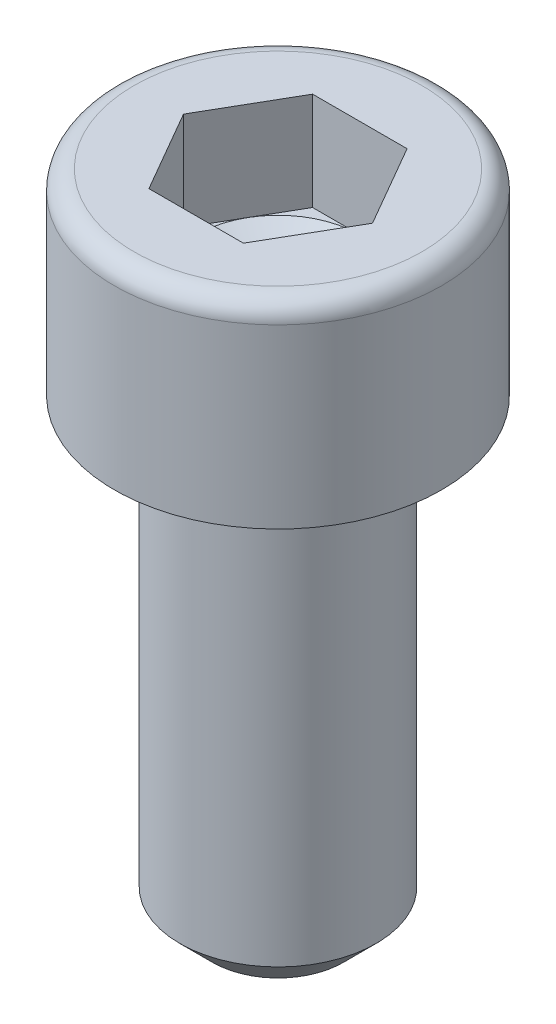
ISO-10303-21;
HEADER;
FILE_DESCRIPTION(('STEP AP214'),'2;1');
FILE_NAME('part.step','',(''),(''),'','','');
FILE_SCHEMA(('AUTOMOTIVE_DESIGN { 1 0 10303 214 1 1 1 1 }'));
ENDSEC;
DATA;
#1=APPLICATION_CONTEXT('core data for automotive mechanical design processes');
#2=APPLICATION_PROTOCOL_DEFINITION('international standard','automotive_design',2000,#1);
#3=PRODUCT_CONTEXT('',#1,'mechanical');
#4=PRODUCT('Part','Part','',(#3));
#5=PRODUCT_RELATED_PRODUCT_CATEGORY('part','',(#4));
#6=PRODUCT_DEFINITION_FORMATION('','',#4);
#7=PRODUCT_DEFINITION_CONTEXT('part definition',#1,'design');
#8=PRODUCT_DEFINITION('design','',#6,#7);
#9=PRODUCT_DEFINITION_SHAPE('','',#8);
#10=(LENGTH_UNIT() NAMED_UNIT(*) SI_UNIT(.MILLI.,.METRE.));
#11=(NAMED_UNIT(*) PLANE_ANGLE_UNIT() SI_UNIT($,.RADIAN.));
#12=(NAMED_UNIT(*) SI_UNIT($,.STERADIAN.) SOLID_ANGLE_UNIT());
#13=UNCERTAINTY_MEASURE_WITH_UNIT(LENGTH_MEASURE(1.E-05),#10,'distance_accuracy_value','');
#14=(GEOMETRIC_REPRESENTATION_CONTEXT(3) GLOBAL_UNCERTAINTY_ASSIGNED_CONTEXT((#13)) GLOBAL_UNIT_ASSIGNED_CONTEXT((#10,
#11,#12)) REPRESENTATION_CONTEXT('',''));
#15=CARTESIAN_POINT('',(0.,0.,0.));
#16=DIRECTION('',(0.,0.,1.));
#17=DIRECTION('',(1.,0.,0.));
#18=AXIS2_PLACEMENT_3D('',#15,#16,#17);
#19=CARTESIAN_POINT('',(-4.33012701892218,3.,2.5));
#20=DIRECTION('',(0.,-1.,0.));
#21=DIRECTION('',(0.,0.,-1.));
#22=AXIS2_PLACEMENT_3D('',#19,#20,#21);
#23=PLANE('',#22);
#24=DIRECTION('',(-0.499999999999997,0.,0.86602540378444));
#25=VECTOR('',#24,1.);
#26=CARTESIAN_POINT('',(2.1650635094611,3.,1.24999999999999));
#27=LINE('',#26,#25);
#28=CARTESIAN_POINT('',(2.16506350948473,2.99999999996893,1.25000000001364));
#29=VERTEX_POINT('',#28);
#30=CARTESIAN_POINT('',(1.44337567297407,3.,2.5));
#31=VERTEX_POINT('',#30);
#32=EDGE_CURVE('E102',#29,#31,#27,.T.);
#33=ORIENTED_EDGE('',*,*,#32,.F.);
#34=CARTESIAN_POINT('',(0.,2.99999999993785,0.));
#35=DIRECTION('',(0.,1.,0.));
#36=DIRECTION('',(0.,0.,1.));
#37=AXIS2_PLACEMENT_3D('',#34,#35,#36);
#38=CIRCLE('',#37,2.50000000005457);
#39=CARTESIAN_POINT('',(0.,2.99999999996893,2.50000000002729));
#40=VERTEX_POINT('',#39);
#41=EDGE_CURVE('E110',#29,#40,#38,.F.);
#42=ORIENTED_EDGE('',*,*,#41,.T.);
#43=DIRECTION('',(1.,0.,0.));
#44=VECTOR('',#43,1.);
#45=CARTESIAN_POINT('',(-4.33012701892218,3.,2.5));
#46=LINE('',#45,#44);
#47=EDGE_CURVE('E79',#31,#40,#46,.F.);
#48=ORIENTED_EDGE('',*,*,#47,.F.);
#49=EDGE_LOOP('',(#33,#42,#48));
#50=FACE_BOUND('',#49,.T.);
#51=ADVANCED_FACE('F16',(#50),#23,.F.);
#52=CARTESIAN_POINT('',(-4.33012701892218,3.,2.5));
#53=DIRECTION('',(0.,-1.,0.));
#54=DIRECTION('',(0.,0.,-1.));
#55=AXIS2_PLACEMENT_3D('',#52,#53,#54);
#56=PLANE('',#55);
#57=DIRECTION('',(1.,0.,0.));
#58=VECTOR('',#57,1.);
#59=CARTESIAN_POINT('',(-4.33012701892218,3.,2.5));
#60=LINE('',#59,#58);
#61=CARTESIAN_POINT('',(-1.44337567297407,3.,2.5));
#62=VERTEX_POINT('',#61);
#63=EDGE_CURVE('E261',#40,#62,#60,.F.);
#64=ORIENTED_EDGE('',*,*,#63,.F.);
#65=CARTESIAN_POINT('',(0.,2.99999999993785,0.));
#66=DIRECTION('',(0.,1.,0.));
#67=DIRECTION('',(0.,0.,1.));
#68=AXIS2_PLACEMENT_3D('',#65,#66,#67);
#69=CIRCLE('',#68,2.50000000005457);
#70=CARTESIAN_POINT('',(-2.16506350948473,2.99999999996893,1.25000000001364));
#71=VERTEX_POINT('',#70);
#72=EDGE_CURVE('E116',#40,#71,#69,.F.);
#73=ORIENTED_EDGE('',*,*,#72,.T.);
#74=DIRECTION('',(-0.499999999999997,0.,-0.86602540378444));
#75=VECTOR('',#74,1.);
#76=CARTESIAN_POINT('',(-1.44337567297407,3.,2.5));
#77=LINE('',#76,#75);
#78=EDGE_CURVE('E259',#62,#71,#77,.T.);
#79=ORIENTED_EDGE('',*,*,#78,.F.);
#80=EDGE_LOOP('',(#64,#73,#79));
#81=FACE_BOUND('',#80,.T.);
#82=ADVANCED_FACE('F263',(#81),#56,.F.);
#83=CARTESIAN_POINT('',(-4.33012701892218,3.,2.5));
#84=DIRECTION('',(0.,-1.,0.));
#85=DIRECTION('',(0.,0.,-1.));
#86=AXIS2_PLACEMENT_3D('',#83,#84,#85);
#87=PLANE('',#86);
#88=DIRECTION('',(1.,0.,0.));
#89=VECTOR('',#88,1.);
#90=CARTESIAN_POINT('',(-4.33012701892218,3.,-2.5));
#91=LINE('',#90,#89);
#92=CARTESIAN_POINT('',(0.,2.99999999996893,-2.50000000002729));
#93=VERTEX_POINT('',#92);
#94=CARTESIAN_POINT('',(1.44337567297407,3.,-2.5));
#95=VERTEX_POINT('',#94);
#96=EDGE_CURVE('E121',#93,#95,#91,.T.);
#97=ORIENTED_EDGE('',*,*,#96,.F.);
#98=CARTESIAN_POINT('',(0.,2.99999999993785,0.));
#99=DIRECTION('',(0.,1.,0.));
#100=DIRECTION('',(0.,0.,1.));
#101=AXIS2_PLACEMENT_3D('',#98,#99,#100);
#102=CIRCLE('',#101,2.50000000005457);
#103=CARTESIAN_POINT('',(2.16506350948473,2.99999999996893,-1.25000000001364));
#104=VERTEX_POINT('',#103);
#105=EDGE_CURVE('E96',#93,#104,#102,.F.);
#106=ORIENTED_EDGE('',*,*,#105,.T.);
#107=DIRECTION('',(0.499999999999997,0.,0.86602540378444));
#108=VECTOR('',#107,1.);
#109=CARTESIAN_POINT('',(1.44337567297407,3.,-2.5));
#110=LINE('',#109,#108);
#111=EDGE_CURVE('E117',#95,#104,#110,.T.);
#112=ORIENTED_EDGE('',*,*,#111,.F.);
#113=EDGE_LOOP('',(#97,#106,#112));
#114=FACE_BOUND('',#113,.T.);
#115=ADVANCED_FACE('F285',(#114),#87,.F.);
#116=CARTESIAN_POINT('',(0.,2.99999999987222,0.));
#117=DIRECTION('',(0.,1.,0.));
#118=DIRECTION('',(0.,0.,1.));
#119=AXIS2_PLACEMENT_3D('',#116,#117,#118);
#120=CONICAL_SURFACE('',#119,2.49999999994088,1.04719755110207);
#121=CARTESIAN_POINT('',(-7.105427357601E-11,1.55662432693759,0.));
#122=VERTEX_POINT('',#121);
#123=VERTEX_LOOP('',#122);
#124=FACE_BOUND('',#123,.T.);
#125=ORIENTED_EDGE('',*,*,#41,.F.);
#126=CARTESIAN_POINT('',(0.,2.99999999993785,0.));
#127=DIRECTION('',(0.,1.,0.));
#128=DIRECTION('',(0.,0.,1.));
#129=AXIS2_PLACEMENT_3D('',#126,#127,#128);
#130=CIRCLE('',#129,2.50000000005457);
#131=EDGE_CURVE('E85',#104,#29,#130,.F.);
#132=ORIENTED_EDGE('',*,*,#131,.F.);
#133=ORIENTED_EDGE('',*,*,#105,.F.);
#134=CARTESIAN_POINT('',(0.,2.99999999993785,0.));
#135=DIRECTION('',(0.,1.,0.));
#136=DIRECTION('',(0.,0.,1.));
#137=AXIS2_PLACEMENT_3D('',#134,#135,#136);
#138=CIRCLE('',#137,2.50000000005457);
#139=CARTESIAN_POINT('',(-2.16506350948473,2.99999999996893,-1.25000000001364));
#140=VERTEX_POINT('',#139);
#141=EDGE_CURVE('E95',#93,#140,#138,.T.);
#142=ORIENTED_EDGE('',*,*,#141,.T.);
#143=CARTESIAN_POINT('',(0.,2.99999999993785,0.));
#144=DIRECTION('',(0.,1.,0.));
#145=DIRECTION('',(0.,0.,1.));
#146=AXIS2_PLACEMENT_3D('',#143,#144,#145);
#147=CIRCLE('',#146,2.50000000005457);
#148=EDGE_CURVE('E119',#71,#140,#147,.F.);
#149=ORIENTED_EDGE('',*,*,#148,.F.);
#150=ORIENTED_EDGE('',*,*,#72,.F.);
#151=EDGE_LOOP('',(#125,#132,#133,#142,#149,#150));
#152=FACE_BOUND('',#151,.T.);
#153=ADVANCED_FACE('F114',(#124,#152),#120,.F.);
#154=CARTESIAN_POINT('',(-4.33012701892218,3.,2.5));
#155=DIRECTION('',(0.,-1.,0.));
#156=DIRECTION('',(0.,0.,-1.));
#157=AXIS2_PLACEMENT_3D('',#154,#155,#156);
#158=PLANE('',#157);
#159=DIRECTION('',(0.499999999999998,0.,-0.86602540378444));
#160=VECTOR('',#159,1.);
#161=CARTESIAN_POINT('',(-1.44337567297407,3.,-2.5));
#162=LINE('',#161,#160);
#163=CARTESIAN_POINT('',(-1.44337567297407,3.,-2.5));
#164=VERTEX_POINT('',#163);
#165=EDGE_CURVE('E203',#140,#164,#162,.T.);
#166=ORIENTED_EDGE('',*,*,#165,.F.);
#167=ORIENTED_EDGE('',*,*,#141,.F.);
#168=DIRECTION('',(1.,0.,0.));
#169=VECTOR('',#168,1.);
#170=CARTESIAN_POINT('',(1.44337567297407,3.,-2.5));
#171=LINE('',#170,#169);
#172=EDGE_CURVE('E204',#164,#93,#171,.T.);
#173=ORIENTED_EDGE('',*,*,#172,.F.);
#174=EDGE_LOOP('',(#166,#167,#173));
#175=FACE_BOUND('',#174,.T.);
#176=ADVANCED_FACE('F245',(#175),#158,.F.);
#177=CARTESIAN_POINT('',(-4.33012701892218,3.,2.5));
#178=DIRECTION('',(0.,-1.,0.));
#179=DIRECTION('',(0.,0.,-1.));
#180=AXIS2_PLACEMENT_3D('',#177,#178,#179);
#181=PLANE('',#180);
#182=DIRECTION('',(-0.499999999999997,0.,-0.86602540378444));
#183=VECTOR('',#182,1.);
#184=CARTESIAN_POINT('',(-1.44337567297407,3.,2.5));
#185=LINE('',#184,#183);
#186=CARTESIAN_POINT('',(-2.88675134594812,3.,0.));
#187=VERTEX_POINT('',#186);
#188=EDGE_CURVE('E189',#71,#187,#185,.T.);
#189=ORIENTED_EDGE('',*,*,#188,.F.);
#190=ORIENTED_EDGE('',*,*,#148,.T.);
#191=DIRECTION('',(0.499999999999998,0.,-0.86602540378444));
#192=VECTOR('',#191,1.);
#193=CARTESIAN_POINT('',(-1.44337567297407,3.,-2.5));
#194=LINE('',#193,#192);
#195=EDGE_CURVE('E200',#187,#140,#194,.T.);
#196=ORIENTED_EDGE('',*,*,#195,.F.);
#197=EDGE_LOOP('',(#189,#190,#196));
#198=FACE_BOUND('',#197,.T.);
#199=ADVANCED_FACE('F239',(#198),#181,.F.);
#200=CARTESIAN_POINT('',(-4.33012701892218,3.,2.5));
#201=DIRECTION('',(0.,-1.,0.));
#202=DIRECTION('',(0.,0.,-1.));
#203=AXIS2_PLACEMENT_3D('',#200,#201,#202);
#204=PLANE('',#203);
#205=DIRECTION('',(0.499999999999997,0.,0.86602540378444));
#206=VECTOR('',#205,1.);
#207=CARTESIAN_POINT('',(1.44337567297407,3.,-2.5));
#208=LINE('',#207,#206);
#209=CARTESIAN_POINT('',(2.88675134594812,3.,0.));
#210=VERTEX_POINT('',#209);
#211=EDGE_CURVE('E91',#104,#210,#208,.T.);
#212=ORIENTED_EDGE('',*,*,#211,.F.);
#213=ORIENTED_EDGE('',*,*,#131,.T.);
#214=DIRECTION('',(-0.499999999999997,0.,0.86602540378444));
#215=VECTOR('',#214,1.);
#216=CARTESIAN_POINT('',(1.44337567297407,3.,2.5));
#217=LINE('',#216,#215);
#218=EDGE_CURVE('E88',#210,#29,#217,.T.);
#219=ORIENTED_EDGE('',*,*,#218,.F.);
#220=EDGE_LOOP('',(#212,#213,#219));
#221=FACE_BOUND('',#220,.T.);
#222=ADVANCED_FACE('F87',(#221),#204,.F.);
#223=CARTESIAN_POINT('',(1.44337567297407,3.,-2.5));
#224=DIRECTION('',(0.,0.,1.));
#225=DIRECTION('',(1.,0.,0.));
#226=AXIS2_PLACEMENT_3D('',#223,#224,#225);
#227=PLANE('',#226);
#228=ORIENTED_EDGE('',*,*,#96,.T.);
#229=DIRECTION('',(0.,1.,0.));
#230=VECTOR('',#229,1.);
#231=CARTESIAN_POINT('',(1.44337567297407,3.,-2.5));
#232=LINE('',#231,#230);
#233=CARTESIAN_POINT('',(1.44337567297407,6.,-2.5));
#234=VERTEX_POINT('',#233);
#235=EDGE_CURVE('E181',#234,#95,#232,.F.);
#236=ORIENTED_EDGE('',*,*,#235,.F.);
#237=DIRECTION('',(1.,0.,0.));
#238=VECTOR('',#237,1.);
#239=CARTESIAN_POINT('',(2.5,6.,-2.5));
#240=LINE('',#239,#238);
#241=CARTESIAN_POINT('',(-1.44337567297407,6.,-2.5));
#242=VERTEX_POINT('',#241);
#243=EDGE_CURVE('E165',#234,#242,#240,.F.);
#244=ORIENTED_EDGE('',*,*,#243,.T.);
#245=DIRECTION('',(0.,1.,0.));
#246=VECTOR('',#245,1.);
#247=CARTESIAN_POINT('',(-1.44337567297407,3.,-2.5));
#248=LINE('',#247,#246);
#249=EDGE_CURVE('E193',#164,#242,#248,.T.);
#250=ORIENTED_EDGE('',*,*,#249,.F.);
#251=ORIENTED_EDGE('',*,*,#172,.T.);
#252=EDGE_LOOP('',(#228,#236,#244,#250,#251));
#253=FACE_BOUND('',#252,.T.);
#254=ADVANCED_FACE('F277',(#253),#227,.T.);
#255=CARTESIAN_POINT('',(-1.44337567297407,3.,-2.5));
#256=DIRECTION('',(0.86602540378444,0.,0.499999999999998));
#257=DIRECTION('',(0.499999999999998,0.,-0.86602540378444));
#258=AXIS2_PLACEMENT_3D('',#255,#256,#257);
#259=PLANE('',#258);
#260=ORIENTED_EDGE('',*,*,#165,.T.);
#261=ORIENTED_EDGE('',*,*,#249,.T.);
#262=DIRECTION('',(-0.499999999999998,0.,0.86602540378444));
#263=VECTOR('',#262,1.);
#264=CARTESIAN_POINT('',(-1.44337567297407,6.,-2.5));
#265=LINE('',#264,#263);
#266=CARTESIAN_POINT('',(-2.88675134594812,6.,0.));
#267=VERTEX_POINT('',#266);
#268=EDGE_CURVE('E252',#242,#267,#265,.T.);
#269=ORIENTED_EDGE('',*,*,#268,.T.);
#270=DIRECTION('',(0.,1.,0.));
#271=VECTOR('',#270,1.);
#272=CARTESIAN_POINT('',(-2.88675134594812,3.,0.));
#273=LINE('',#272,#271);
#274=EDGE_CURVE('E192',#187,#267,#273,.T.);
#275=ORIENTED_EDGE('',*,*,#274,.F.);
#276=ORIENTED_EDGE('',*,*,#195,.T.);
#277=EDGE_LOOP('',(#260,#261,#269,#275,#276));
#278=FACE_BOUND('',#277,.T.);
#279=ADVANCED_FACE('F248',(#278),#259,.T.);
#280=CARTESIAN_POINT('',(-1.44337567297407,3.,2.5));
#281=DIRECTION('',(0.86602540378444,0.,-0.499999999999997));
#282=DIRECTION('',(-0.499999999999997,0.,-0.86602540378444));
#283=AXIS2_PLACEMENT_3D('',#280,#281,#282);
#284=PLANE('',#283);
#285=ORIENTED_EDGE('',*,*,#188,.T.);
#286=ORIENTED_EDGE('',*,*,#274,.T.);
#287=DIRECTION('',(0.499999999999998,0.,0.86602540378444));
#288=VECTOR('',#287,1.);
#289=CARTESIAN_POINT('',(-2.88675134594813,6.,0.));
#290=LINE('',#289,#288);
#291=CARTESIAN_POINT('',(-1.44337567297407,6.,2.5));
#292=VERTEX_POINT('',#291);
#293=EDGE_CURVE('E434',#267,#292,#290,.T.);
#294=ORIENTED_EDGE('',*,*,#293,.T.);
#295=DIRECTION('',(0.,1.,0.));
#296=VECTOR('',#295,1.);
#297=CARTESIAN_POINT('',(-1.44337567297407,3.,2.5));
#298=LINE('',#297,#296);
#299=EDGE_CURVE('E107',#62,#292,#298,.T.);
#300=ORIENTED_EDGE('',*,*,#299,.F.);
#301=ORIENTED_EDGE('',*,*,#78,.T.);
#302=EDGE_LOOP('',(#285,#286,#294,#300,#301));
#303=FACE_BOUND('',#302,.T.);
#304=ADVANCED_FACE('F256',(#303),#284,.T.);
#305=CARTESIAN_POINT('',(1.44337567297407,3.,2.5));
#306=DIRECTION('',(0.,0.,-1.));
#307=DIRECTION('',(-1.,0.,0.));
#308=AXIS2_PLACEMENT_3D('',#305,#306,#307);
#309=PLANE('',#308);
#310=ORIENTED_EDGE('',*,*,#63,.T.);
#311=ORIENTED_EDGE('',*,*,#299,.T.);
#312=DIRECTION('',(1.,0.,0.));
#313=VECTOR('',#312,1.);
#314=CARTESIAN_POINT('',(2.5,6.,2.5));
#315=LINE('',#314,#313);
#316=CARTESIAN_POINT('',(1.44337567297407,6.,2.5));
#317=VERTEX_POINT('',#316);
#318=EDGE_CURVE('E435',#292,#317,#315,.T.);
#319=ORIENTED_EDGE('',*,*,#318,.T.);
#320=DIRECTION('',(0.,1.,0.));
#321=VECTOR('',#320,1.);
#322=CARTESIAN_POINT('',(1.44337567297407,3.,2.5));
#323=LINE('',#322,#321);
#324=EDGE_CURVE('E106',#31,#317,#323,.T.);
#325=ORIENTED_EDGE('',*,*,#324,.F.);
#326=ORIENTED_EDGE('',*,*,#47,.T.);
#327=EDGE_LOOP('',(#310,#311,#319,#325,#326));
#328=FACE_BOUND('',#327,.T.);
#329=ADVANCED_FACE('F362',(#328),#309,.T.);
#330=CARTESIAN_POINT('',(1.44337567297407,3.,2.5));
#331=DIRECTION('',(-0.86602540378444,0.,-0.499999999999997));
#332=DIRECTION('',(-0.499999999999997,0.,0.86602540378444));
#333=AXIS2_PLACEMENT_3D('',#330,#331,#332);
#334=PLANE('',#333);
#335=ORIENTED_EDGE('',*,*,#32,.T.);
#336=ORIENTED_EDGE('',*,*,#324,.T.);
#337=DIRECTION('',(0.499999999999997,0.,-0.86602540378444));
#338=VECTOR('',#337,1.);
#339=CARTESIAN_POINT('',(1.44337567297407,6.,2.5));
#340=LINE('',#339,#338);
#341=CARTESIAN_POINT('',(2.88675134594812,6.,0.));
#342=VERTEX_POINT('',#341);
#343=EDGE_CURVE('E438',#317,#342,#340,.T.);
#344=ORIENTED_EDGE('',*,*,#343,.T.);
#345=DIRECTION('',(0.,1.,0.));
#346=VECTOR('',#345,1.);
#347=CARTESIAN_POINT('',(2.88675134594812,3.,0.));
#348=LINE('',#347,#346);
#349=EDGE_CURVE('E105',#210,#342,#348,.T.);
#350=ORIENTED_EDGE('',*,*,#349,.F.);
#351=ORIENTED_EDGE('',*,*,#218,.T.);
#352=EDGE_LOOP('',(#335,#336,#344,#350,#351));
#353=FACE_BOUND('',#352,.T.);
#354=ADVANCED_FACE('F100',(#353),#334,.T.);
#355=CARTESIAN_POINT('',(1.44337567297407,3.,-2.5));
#356=DIRECTION('',(-0.86602540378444,0.,0.499999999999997));
#357=DIRECTION('',(0.499999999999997,0.,0.86602540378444));
#358=AXIS2_PLACEMENT_3D('',#355,#356,#357);
#359=PLANE('',#358);
#360=ORIENTED_EDGE('',*,*,#211,.T.);
#361=ORIENTED_EDGE('',*,*,#349,.T.);
#362=DIRECTION('',(-0.499999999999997,0.,-0.86602540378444));
#363=VECTOR('',#362,1.);
#364=CARTESIAN_POINT('',(2.88675134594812,6.,0.));
#365=LINE('',#364,#363);
#366=EDGE_CURVE('E129',#342,#234,#365,.T.);
#367=ORIENTED_EDGE('',*,*,#366,.T.);
#368=ORIENTED_EDGE('',*,*,#235,.T.);
#369=ORIENTED_EDGE('',*,*,#111,.T.);
#370=EDGE_LOOP('',(#360,#361,#367,#368,#369));
#371=FACE_BOUND('',#370,.T.);
#372=ADVANCED_FACE('F150',(#371),#359,.T.);
#373=CARTESIAN_POINT('',(2.5,6.,0.));
#374=DIRECTION('',(0.,-1.,0.));
#375=DIRECTION('',(1.,0.,0.));
#376=AXIS2_PLACEMENT_3D('',#373,#374,#375);
#377=PLANE('',#376);
#378=ORIENTED_EDGE('',*,*,#343,.F.);
#379=ORIENTED_EDGE('',*,*,#318,.F.);
#380=ORIENTED_EDGE('',*,*,#293,.F.);
#381=ORIENTED_EDGE('',*,*,#268,.F.);
#382=ORIENTED_EDGE('',*,*,#243,.F.);
#383=ORIENTED_EDGE('',*,*,#366,.F.);
#384=EDGE_LOOP('',(#378,#379,#380,#381,#382,#383));
#385=FACE_BOUND('',#384,.T.);
#386=CARTESIAN_POINT('',(0.,6.,0.));
#387=DIRECTION('',(0.,-1.,0.));
#388=DIRECTION('',(-1.,0.,0.));
#389=AXIS2_PLACEMENT_3D('',#386,#387,#388);
#390=CIRCLE('',#389,4.4);
#391=CARTESIAN_POINT('',(-4.4,6.,0.));
#392=VERTEX_POINT('',#391);
#393=CARTESIAN_POINT('',(4.4,6.,0.));
#394=VERTEX_POINT('',#393);
#395=EDGE_CURVE('E36',#392,#394,#390,.T.);
#396=ORIENTED_EDGE('',*,*,#395,.F.);
#397=CARTESIAN_POINT('',(0.,6.,0.));
#398=DIRECTION('',(0.,-1.,0.));
#399=DIRECTION('',(1.,0.,0.));
#400=AXIS2_PLACEMENT_3D('',#397,#398,#399);
#401=CIRCLE('',#400,4.4);
#402=EDGE_CURVE('E127',#394,#392,#401,.T.);
#403=ORIENTED_EDGE('',*,*,#402,.F.);
#404=EDGE_LOOP('',(#396,#403));
#405=FACE_BOUND('',#404,.T.);
#406=ADVANCED_FACE('F131',(#385,#405),#377,.F.);
#407=CARTESIAN_POINT('',(0.,5.4,0.));
#408=DIRECTION('',(0.,1.,0.));
#409=DIRECTION('',(-1.,0.,0.));
#410=AXIS2_PLACEMENT_3D('',#407,#408,#409);
#411=TOROIDAL_SURFACE('',#410,4.4,0.6);
#412=ORIENTED_EDGE('',*,*,#395,.T.);
#413=ORIENTED_EDGE('',*,*,#402,.T.);
#414=EDGE_LOOP('',(#412,#413));
#415=FACE_BOUND('',#414,.T.);
#416=CARTESIAN_POINT('',(0.,5.4,0.));
#417=DIRECTION('',(0.,1.,0.));
#418=DIRECTION('',(-1.,0.,0.));
#419=AXIS2_PLACEMENT_3D('',#416,#417,#418);
#420=CIRCLE('',#419,5.);
#421=CARTESIAN_POINT('',(-5.,5.4,0.));
#422=VERTEX_POINT('',#421);
#423=EDGE_CURVE('E132',#422,#422,#420,.F.);
#424=ORIENTED_EDGE('',*,*,#423,.F.);
#425=EDGE_LOOP('',(#424));
#426=FACE_BOUND('',#425,.T.);
#427=ADVANCED_FACE('F125',(#415,#426),#411,.T.);
#428=CARTESIAN_POINT('',(0.,-14.,0.));
#429=DIRECTION('',(0.,1.,0.));
#430=DIRECTION('',(0.,0.,1.));
#431=AXIS2_PLACEMENT_3D('',#428,#429,#430);
#432=PLANE('',#431);
#433=CARTESIAN_POINT('',(0.,-14.00000000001,0.));
#434=DIRECTION('',(0.,1.,0.));
#435=DIRECTION('',(0.,0.,1.));
#436=AXIS2_PLACEMENT_3D('',#433,#434,#435);
#437=CIRCLE('',#436,1.99999999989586);
#438=CARTESIAN_POINT('',(0.,-14.00000000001,1.99999999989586));
#439=VERTEX_POINT('',#438);
#440=EDGE_CURVE('E171',#439,#439,#437,.T.);
#441=ORIENTED_EDGE('',*,*,#440,.F.);
#442=EDGE_LOOP('',(#441));
#443=FACE_BOUND('',#442,.T.);
#444=ADVANCED_FACE('F158',(#443),#432,.F.);
#445=CARTESIAN_POINT('',(0.,6.,0.));
#446=DIRECTION('',(0.,1.,0.));
#447=DIRECTION('',(-1.,0.,0.));
#448=AXIS2_PLACEMENT_3D('',#445,#446,#447);
#449=CYLINDRICAL_SURFACE('',#448,5.);
#450=ORIENTED_EDGE('',*,*,#423,.T.);
#451=EDGE_LOOP('',(#450));
#452=FACE_BOUND('',#451,.T.);
#453=CARTESIAN_POINT('',(0.,0.,0.));
#454=DIRECTION('',(0.,1.,0.));
#455=DIRECTION('',(-1.,0.,0.));
#456=AXIS2_PLACEMENT_3D('',#453,#454,#455);
#457=CIRCLE('',#456,5.);
#458=CARTESIAN_POINT('',(-5.,0.,0.));
#459=VERTEX_POINT('',#458);
#460=EDGE_CURVE('E169',#459,#459,#457,.T.);
#461=ORIENTED_EDGE('',*,*,#460,.T.);
#462=EDGE_LOOP('',(#461));
#463=FACE_BOUND('',#462,.T.);
#464=ADVANCED_FACE('F310',(#452,#463),#449,.T.);
#465=CARTESIAN_POINT('',(0.,-12.9999999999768,0.));
#466=DIRECTION('',(0.,1.,0.));
#467=DIRECTION('',(0.,0.,1.));
#468=AXIS2_PLACEMENT_3D('',#465,#466,#467);
#469=CONICAL_SURFACE('',#468,2.99999999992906,0.785398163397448);
#470=CARTESIAN_POINT('',(0.,-13.,0.));
#471=DIRECTION('',(0.,1.,0.));
#472=DIRECTION('',(0.,0.,1.));
#473=AXIS2_PLACEMENT_3D('',#470,#471,#472);
#474=CIRCLE('',#473,3.);
#475=CARTESIAN_POINT('',(0.,-13.,3.));
#476=VERTEX_POINT('',#475);
#477=EDGE_CURVE('E28',#476,#476,#474,.T.);
#478=ORIENTED_EDGE('',*,*,#477,.F.);
#479=EDGE_LOOP('',(#478));
#480=FACE_BOUND('',#479,.T.);
#481=ORIENTED_EDGE('',*,*,#440,.T.);
#482=EDGE_LOOP('',(#481));
#483=FACE_BOUND('',#482,.T.);
#484=ADVANCED_FACE('F302',(#480,#483),#469,.T.);
#485=CARTESIAN_POINT('',(0.,0.,0.));
#486=DIRECTION('',(0.,1.,0.));
#487=DIRECTION('',(-1.,0.,0.));
#488=AXIS2_PLACEMENT_3D('',#485,#486,#487);
#489=PLANE('',#488);
#490=ORIENTED_EDGE('',*,*,#460,.F.);
#491=EDGE_LOOP('',(#490));
#492=FACE_BOUND('',#491,.T.);
#493=CARTESIAN_POINT('',(0.,0.,0.));
#494=DIRECTION('',(0.,1.,0.));
#495=DIRECTION('',(0.,0.,1.));
#496=AXIS2_PLACEMENT_3D('',#493,#494,#495);
#497=CIRCLE('',#496,3.);
#498=CARTESIAN_POINT('',(0.,0.,3.));
#499=VERTEX_POINT('',#498);
#500=EDGE_CURVE('E10',#499,#499,#497,.F.);
#501=ORIENTED_EDGE('',*,*,#500,.F.);
#502=EDGE_LOOP('',(#501));
#503=FACE_BOUND('',#502,.T.);
#504=ADVANCED_FACE('F297',(#492,#503),#489,.F.);
#505=CARTESIAN_POINT('',(0.,-14.,0.));
#506=DIRECTION('',(0.,1.,0.));
#507=DIRECTION('',(0.,0.,1.));
#508=AXIS2_PLACEMENT_3D('',#505,#506,#507);
#509=CYLINDRICAL_SURFACE('',#508,3.);
#510=ORIENTED_EDGE('',*,*,#500,.T.);
#511=EDGE_LOOP('',(#510));
#512=FACE_BOUND('',#511,.T.);
#513=ORIENTED_EDGE('',*,*,#477,.T.);
#514=EDGE_LOOP('',(#513));
#515=FACE_BOUND('',#514,.T.);
#516=ADVANCED_FACE('F18',(#512,#515),#509,.T.);
#517=CLOSED_SHELL('',(#51,#82,#115,#153,#176,#199,#222,#254,#279,#304,#329,#354,#372,#406,#427,
#444,#464,#484,#504,#516));
#518=MANIFOLD_SOLID_BREP('B1',#517);
#519=ADVANCED_BREP_SHAPE_REPRESENTATION('',(#18,#518),#14);
#520=SHAPE_DEFINITION_REPRESENTATION(#9,#519);
ENDSEC;
END-ISO-10303-21;
